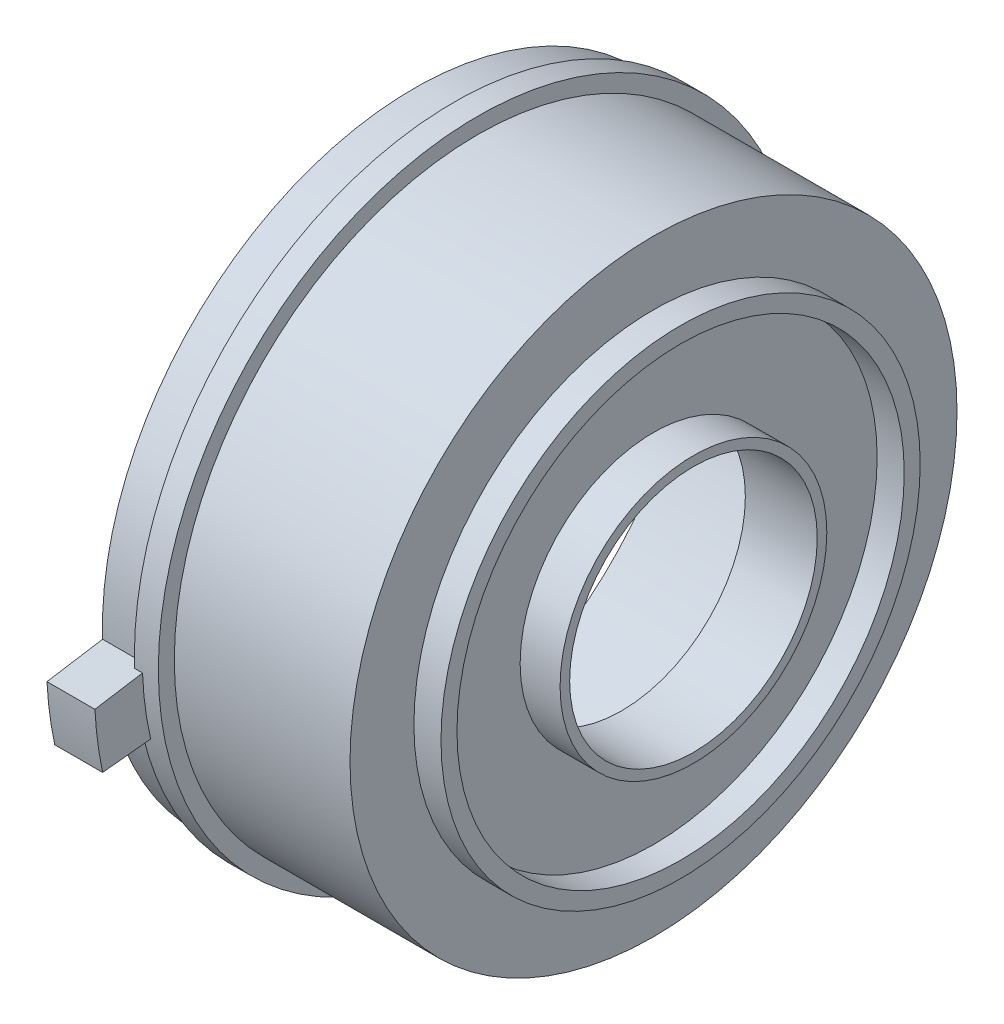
ISO-10303-21;
HEADER;
FILE_DESCRIPTION(('STEP AP214'),'2;1');
FILE_NAME('part.step','',(''),(''),'','','');
FILE_SCHEMA(('AUTOMOTIVE_DESIGN { 1 0 10303 214 1 1 1 1 }'));
ENDSEC;
DATA;
#1=APPLICATION_CONTEXT('core data for automotive mechanical design processes');
#2=APPLICATION_PROTOCOL_DEFINITION('international standard','automotive_design',2000,#1);
#3=PRODUCT_CONTEXT('',#1,'mechanical');
#4=PRODUCT('Part','Part','',(#3));
#5=PRODUCT_RELATED_PRODUCT_CATEGORY('part','',(#4));
#6=PRODUCT_DEFINITION_FORMATION('','',#4);
#7=PRODUCT_DEFINITION_CONTEXT('part definition',#1,'design');
#8=PRODUCT_DEFINITION('design','',#6,#7);
#9=PRODUCT_DEFINITION_SHAPE('','',#8);
#10=(LENGTH_UNIT() NAMED_UNIT(*) SI_UNIT(.MILLI.,.METRE.));
#11=(NAMED_UNIT(*) PLANE_ANGLE_UNIT() SI_UNIT($,.RADIAN.));
#12=(NAMED_UNIT(*) SI_UNIT($,.STERADIAN.) SOLID_ANGLE_UNIT());
#13=UNCERTAINTY_MEASURE_WITH_UNIT(LENGTH_MEASURE(1.E-05),#10,'distance_accuracy_value','');
#14=(GEOMETRIC_REPRESENTATION_CONTEXT(3) GLOBAL_UNCERTAINTY_ASSIGNED_CONTEXT((#13)) GLOBAL_UNIT_ASSIGNED_CONTEXT((#10,
#11,#12)) REPRESENTATION_CONTEXT('',''));
#15=CARTESIAN_POINT('',(0.,0.,0.));
#16=DIRECTION('',(0.,0.,1.));
#17=DIRECTION('',(1.,0.,0.));
#18=AXIS2_PLACEMENT_3D('',#15,#16,#17);
#19=CARTESIAN_POINT('',(0.,0.,0.));
#20=DIRECTION('',(-1.,0.,0.));
#21=DIRECTION('',(0.,0.,1.));
#22=AXIS2_PLACEMENT_3D('',#19,#20,#21);
#23=CYLINDRICAL_SURFACE('',#22,19.);
#24=CARTESIAN_POINT('',(101.,0.,0.));
#25=DIRECTION('',(-1.,0.,0.));
#26=DIRECTION('',(0.,0.,1.));
#27=AXIS2_PLACEMENT_3D('',#24,#25,#26);
#28=CIRCLE('',#27,19.);
#29=CARTESIAN_POINT('',(101.,0.,19.));
#30=VERTEX_POINT('',#29);
#31=EDGE_CURVE('E38',#30,#30,#28,.T.);
#32=ORIENTED_EDGE('',*,*,#31,.F.);
#33=EDGE_LOOP('',(#32));
#34=FACE_BOUND('',#33,.T.);
#35=CARTESIAN_POINT('',(112.,0.,0.));
#36=DIRECTION('',(-1.,0.,0.));
#37=DIRECTION('',(0.,0.,1.));
#38=AXIS2_PLACEMENT_3D('',#35,#36,#37);
#39=CIRCLE('',#38,19.);
#40=CARTESIAN_POINT('',(112.,0.,19.));
#41=VERTEX_POINT('',#40);
#42=EDGE_CURVE('E127',#41,#41,#39,.T.);
#43=ORIENTED_EDGE('',*,*,#42,.T.);
#44=EDGE_LOOP('',(#43));
#45=FACE_BOUND('',#44,.T.);
#46=ADVANCED_FACE('F31',(#34,#45),#23,.T.);
#47=CARTESIAN_POINT('',(101.,19.9999999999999,0.));
#48=DIRECTION('',(-1.,0.,0.));
#49=DIRECTION('',(0.,0.,1.));
#50=AXIS2_PLACEMENT_3D('',#47,#48,#49);
#51=PLANE('',#50);
#52=CARTESIAN_POINT('',(101.,0.,0.));
#53=DIRECTION('',(-1.,0.,0.));
#54=DIRECTION('',(0.,0.,1.));
#55=AXIS2_PLACEMENT_3D('',#52,#53,#54);
#56=CIRCLE('',#55,19.9999999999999);
#57=CARTESIAN_POINT('',(101.,0.,19.9999999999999));
#58=VERTEX_POINT('',#57);
#59=EDGE_CURVE('E168',#58,#58,#56,.T.);
#60=ORIENTED_EDGE('',*,*,#59,.F.);
#61=EDGE_LOOP('',(#60));
#62=FACE_BOUND('',#61,.T.);
#63=ORIENTED_EDGE('',*,*,#31,.T.);
#64=EDGE_LOOP('',(#63));
#65=FACE_BOUND('',#64,.T.);
#66=ADVANCED_FACE('F173',(#62,#65),#51,.F.);
#67=CARTESIAN_POINT('',(0.,0.,0.));
#68=DIRECTION('',(-1.,0.,0.));
#69=DIRECTION('',(0.,0.,1.));
#70=AXIS2_PLACEMENT_3D('',#67,#68,#69);
#71=CYLINDRICAL_SURFACE('',#70,19.9999999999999);
#72=CARTESIAN_POINT('',(99.9999999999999,0.,0.));
#73=DIRECTION('',(-1.,0.,0.));
#74=DIRECTION('',(0.,0.,1.));
#75=AXIS2_PLACEMENT_3D('',#72,#73,#74);
#76=CIRCLE('',#75,19.9999999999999);
#77=CARTESIAN_POINT('',(99.9999999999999,-4.53165061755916,19.4798393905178));
#78=VERTEX_POINT('',#77);
#79=CARTESIAN_POINT('',(99.9999999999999,-0.697530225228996,19.9878325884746));
#80=VERTEX_POINT('',#79);
#81=EDGE_CURVE('E11',#78,#80,#76,.T.);
#82=ORIENTED_EDGE('',*,*,#81,.F.);
#83=DIRECTION('',(-1.,0.,0.));
#84=VECTOR('',#83,1.);
#85=CARTESIAN_POINT('',(0.,-4.53165061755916,19.4798393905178));
#86=LINE('',#85,#84);
#87=CARTESIAN_POINT('',(99.4999999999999,-4.53165061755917,19.4798393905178));
#88=VERTEX_POINT('',#87);
#89=EDGE_CURVE('E125',#78,#88,#86,.T.);
#90=ORIENTED_EDGE('',*,*,#89,.T.);
#91=CARTESIAN_POINT('',(99.4999999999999,0.,0.));
#92=DIRECTION('',(-1.,0.,0.));
#93=DIRECTION('',(0.,0.,1.));
#94=AXIS2_PLACEMENT_3D('',#91,#92,#93);
#95=CIRCLE('',#94,19.9999999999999);
#96=CARTESIAN_POINT('',(99.4999999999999,-0.697530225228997,19.9878325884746));
#97=VERTEX_POINT('',#96);
#98=EDGE_CURVE('E165',#97,#88,#95,.T.);
#99=ORIENTED_EDGE('',*,*,#98,.F.);
#100=DIRECTION('',(-1.,0.,0.));
#101=VECTOR('',#100,1.);
#102=CARTESIAN_POINT('',(0.,-0.697530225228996,19.9878325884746));
#103=LINE('',#102,#101);
#104=EDGE_CURVE('E119',#97,#80,#103,.F.);
#105=ORIENTED_EDGE('',*,*,#104,.T.);
#106=EDGE_LOOP('',(#82,#90,#99,#105));
#107=FACE_BOUND('',#106,.T.);
#108=ORIENTED_EDGE('',*,*,#59,.T.);
#109=EDGE_LOOP('',(#108));
#110=FACE_BOUND('',#109,.T.);
#111=ADVANCED_FACE('F251',(#107,#110),#71,.T.);
#112=CARTESIAN_POINT('',(99.4999999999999,19.5,0.));
#113=DIRECTION('',(1.,0.,0.));
#114=DIRECTION('',(0.,0.,-1.));
#115=AXIS2_PLACEMENT_3D('',#112,#113,#114);
#116=PLANE('',#115);
#117=ORIENTED_EDGE('',*,*,#98,.T.);
#118=DIRECTION('',(0.,0.103785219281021,-0.994599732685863));
#119=VECTOR('',#118,1.);
#120=CARTESIAN_POINT('',(99.4999999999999,-2.26199519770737,-2.27083656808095));
#121=LINE('',#120,#119);
#122=CARTESIAN_POINT('',(99.4999999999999,-4.47934207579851,18.9785535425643));
#123=VERTEX_POINT('',#122);
#124=EDGE_CURVE('E53',#88,#123,#121,.T.);
#125=ORIENTED_EDGE('',*,*,#124,.T.);
#126=CARTESIAN_POINT('',(99.4999999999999,0.,0.));
#127=DIRECTION('',(-1.,0.,0.));
#128=DIRECTION('',(0.,0.,1.));
#129=AXIS2_PLACEMENT_3D('',#126,#127,#128);
#130=CIRCLE('',#129,19.5);
#131=CARTESIAN_POINT('',(99.4999999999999,-0.617492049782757,19.4902207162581));
#132=VERTEX_POINT('',#131);
#133=EDGE_CURVE('E162',#132,#123,#130,.T.);
#134=ORIENTED_EDGE('',*,*,#133,.F.);
#135=DIRECTION('',(0.,-0.158803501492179,0.987310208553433));
#136=VECTOR('',#135,1.);
#137=CARTESIAN_POINT('',(99.4999999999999,2.94568089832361,-2.66267259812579));
#138=LINE('',#137,#136);
#139=EDGE_CURVE('E116',#132,#97,#138,.T.);
#140=ORIENTED_EDGE('',*,*,#139,.T.);
#141=EDGE_LOOP('',(#117,#125,#134,#140));
#142=FACE_BOUND('',#141,.T.);
#143=ADVANCED_FACE('F248',(#142),#116,.F.);
#144=CARTESIAN_POINT('',(0.,0.,0.));
#145=DIRECTION('',(-1.,0.,0.));
#146=DIRECTION('',(0.,0.,1.));
#147=AXIS2_PLACEMENT_3D('',#144,#145,#146);
#148=CYLINDRICAL_SURFACE('',#147,19.5);
#149=ORIENTED_EDGE('',*,*,#133,.T.);
#150=DIRECTION('',(-1.,0.,0.));
#151=VECTOR('',#150,1.);
#152=CARTESIAN_POINT('',(0.,-4.47934207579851,18.9785535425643));
#153=LINE('',#152,#151);
#154=CARTESIAN_POINT('',(96.9999999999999,-4.47934207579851,18.9785535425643));
#155=VERTEX_POINT('',#154);
#156=EDGE_CURVE('E121',#123,#155,#153,.T.);
#157=ORIENTED_EDGE('',*,*,#156,.T.);
#158=CARTESIAN_POINT('',(96.9999999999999,0.,0.));
#159=DIRECTION('',(-1.,0.,0.));
#160=DIRECTION('',(0.,0.,1.));
#161=AXIS2_PLACEMENT_3D('',#158,#159,#160);
#162=CIRCLE('',#161,19.5);
#163=CARTESIAN_POINT('',(96.9999999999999,-0.617492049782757,19.4902207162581));
#164=VERTEX_POINT('',#163);
#165=EDGE_CURVE('E160',#164,#155,#162,.T.);
#166=ORIENTED_EDGE('',*,*,#165,.F.);
#167=DIRECTION('',(-1.,0.,0.));
#168=VECTOR('',#167,1.);
#169=CARTESIAN_POINT('',(0.,-0.617492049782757,19.4902207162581));
#170=LINE('',#169,#168);
#171=EDGE_CURVE('E112',#164,#132,#170,.F.);
#172=ORIENTED_EDGE('',*,*,#171,.T.);
#173=EDGE_LOOP('',(#149,#157,#166,#172));
#174=FACE_BOUND('',#173,.T.);
#175=ADVANCED_FACE('F241',(#174),#148,.T.);
#176=CARTESIAN_POINT('',(96.9999999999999,19.5,0.));
#177=DIRECTION('',(1.,0.,0.));
#178=DIRECTION('',(0.,0.,-1.));
#179=AXIS2_PLACEMENT_3D('',#176,#177,#178);
#180=PLANE('',#179);
#181=CARTESIAN_POINT('',(96.9999999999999,0.,0.));
#182=DIRECTION('',(-1.,0.,0.));
#183=DIRECTION('',(0.,0.,1.));
#184=AXIS2_PLACEMENT_3D('',#181,#182,#183);
#185=CIRCLE('',#184,17.5);
#186=CARTESIAN_POINT('',(96.9999999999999,0.,17.5));
#187=VERTEX_POINT('',#186);
#188=EDGE_CURVE('E157',#187,#187,#185,.T.);
#189=ORIENTED_EDGE('',*,*,#188,.F.);
#190=EDGE_LOOP('',(#189));
#191=FACE_BOUND('',#190,.T.);
#192=ORIENTED_EDGE('',*,*,#165,.T.);
#193=DIRECTION('',(0.,-0.103785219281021,0.994599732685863));
#194=VECTOR('',#193,1.);
#195=CARTESIAN_POINT('',(96.9999999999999,-4.42701136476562,18.4770552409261));
#196=LINE('',#195,#194);
#197=CARTESIAN_POINT('',(96.9999999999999,-4.84511836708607,22.4838792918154));
#198=VERTEX_POINT('',#197);
#199=EDGE_CURVE('E104',#155,#198,#196,.T.);
#200=ORIENTED_EDGE('',*,*,#199,.T.);
#201=CARTESIAN_POINT('',(96.9999999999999,0.,0.));
#202=DIRECTION('',(-1.,0.,0.));
#203=DIRECTION('',(0.,0.,1.));
#204=AXIS2_PLACEMENT_3D('',#201,#202,#203);
#205=CIRCLE('',#204,23.);
#206=CARTESIAN_POINT('',(96.9999999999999,-1.17717247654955,22.969855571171));
#207=VERTEX_POINT('',#206);
#208=EDGE_CURVE('E109',#198,#207,#205,.T.);
#209=ORIENTED_EDGE('',*,*,#208,.T.);
#210=DIRECTION('',(0.,0.158803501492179,-0.987310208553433));
#211=VECTOR('',#210,1.);
#212=CARTESIAN_POINT('',(96.9999999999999,-1.17717247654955,22.969855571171));
#213=LINE('',#212,#211);
#214=EDGE_CURVE('E45',#207,#164,#213,.T.);
#215=ORIENTED_EDGE('',*,*,#214,.T.);
#216=EDGE_LOOP('',(#192,#200,#209,#215));
#217=FACE_BOUND('',#216,.T.);
#218=ADVANCED_FACE('F236',(#191,#217),#180,.F.);
#219=CARTESIAN_POINT('',(0.,0.,0.));
#220=DIRECTION('',(-1.,0.,0.));
#221=DIRECTION('',(0.,0.,1.));
#222=AXIS2_PLACEMENT_3D('',#219,#220,#221);
#223=CYLINDRICAL_SURFACE('',#222,17.5);
#224=CARTESIAN_POINT('',(110.,0.,0.));
#225=DIRECTION('',(-1.,0.,0.));
#226=DIRECTION('',(0.,0.,1.));
#227=AXIS2_PLACEMENT_3D('',#224,#225,#226);
#228=CIRCLE('',#227,17.5);
#229=CARTESIAN_POINT('',(110.,0.,17.5));
#230=VERTEX_POINT('',#229);
#231=EDGE_CURVE('E154',#230,#230,#228,.T.);
#232=ORIENTED_EDGE('',*,*,#231,.F.);
#233=EDGE_LOOP('',(#232));
#234=FACE_BOUND('',#233,.T.);
#235=ORIENTED_EDGE('',*,*,#188,.T.);
#236=EDGE_LOOP('',(#235));
#237=FACE_BOUND('',#236,.T.);
#238=ADVANCED_FACE('F230',(#234,#237),#223,.F.);
#239=CARTESIAN_POINT('',(110.,17.5,0.));
#240=DIRECTION('',(1.,0.,0.));
#241=DIRECTION('',(0.,0.,-1.));
#242=AXIS2_PLACEMENT_3D('',#239,#240,#241);
#243=PLANE('',#242);
#244=CARTESIAN_POINT('',(110.,0.,0.));
#245=DIRECTION('',(-1.,0.,0.));
#246=DIRECTION('',(0.,0.,1.));
#247=AXIS2_PLACEMENT_3D('',#244,#245,#246);
#248=CIRCLE('',#247,7.75);
#249=CARTESIAN_POINT('',(110.,0.,7.75));
#250=VERTEX_POINT('',#249);
#251=EDGE_CURVE('E151',#250,#250,#248,.T.);
#252=ORIENTED_EDGE('',*,*,#251,.F.);
#253=EDGE_LOOP('',(#252));
#254=FACE_BOUND('',#253,.T.);
#255=ORIENTED_EDGE('',*,*,#231,.T.);
#256=EDGE_LOOP('',(#255));
#257=FACE_BOUND('',#256,.T.);
#258=ADVANCED_FACE('F224',(#254,#257),#243,.F.);
#259=CARTESIAN_POINT('',(0.,0.,0.));
#260=DIRECTION('',(-1.,0.,0.));
#261=DIRECTION('',(0.,0.,1.));
#262=AXIS2_PLACEMENT_3D('',#259,#260,#261);
#263=CYLINDRICAL_SURFACE('',#262,7.75);
#264=CARTESIAN_POINT('',(114.5,0.,0.));
#265=DIRECTION('',(-1.,0.,0.));
#266=DIRECTION('',(0.,0.,1.));
#267=AXIS2_PLACEMENT_3D('',#264,#265,#266);
#268=CIRCLE('',#267,7.75);
#269=CARTESIAN_POINT('',(114.5,0.,7.75));
#270=VERTEX_POINT('',#269);
#271=EDGE_CURVE('E148',#270,#270,#268,.T.);
#272=ORIENTED_EDGE('',*,*,#271,.F.);
#273=EDGE_LOOP('',(#272));
#274=FACE_BOUND('',#273,.T.);
#275=ORIENTED_EDGE('',*,*,#251,.T.);
#276=EDGE_LOOP('',(#275));
#277=FACE_BOUND('',#276,.T.);
#278=ADVANCED_FACE('F218',(#274,#277),#263,.F.);
#279=CARTESIAN_POINT('',(114.5,8.35,0.));
#280=DIRECTION('',(-1.,0.,0.));
#281=DIRECTION('',(0.,0.,1.));
#282=AXIS2_PLACEMENT_3D('',#279,#280,#281);
#283=PLANE('',#282);
#284=CARTESIAN_POINT('',(114.5,0.,0.));
#285=DIRECTION('',(-1.,0.,0.));
#286=DIRECTION('',(0.,0.,1.));
#287=AXIS2_PLACEMENT_3D('',#284,#285,#286);
#288=CIRCLE('',#287,8.35);
#289=CARTESIAN_POINT('',(114.5,0.,8.35));
#290=VERTEX_POINT('',#289);
#291=EDGE_CURVE('E145',#290,#290,#288,.T.);
#292=ORIENTED_EDGE('',*,*,#291,.F.);
#293=EDGE_LOOP('',(#292));
#294=FACE_BOUND('',#293,.T.);
#295=ORIENTED_EDGE('',*,*,#271,.T.);
#296=EDGE_LOOP('',(#295));
#297=FACE_BOUND('',#296,.T.);
#298=ADVANCED_FACE('F212',(#294,#297),#283,.F.);
#299=CARTESIAN_POINT('',(0.,0.,0.));
#300=DIRECTION('',(-1.,0.,0.));
#301=DIRECTION('',(0.,0.,1.));
#302=AXIS2_PLACEMENT_3D('',#299,#300,#301);
#303=CYLINDRICAL_SURFACE('',#302,8.35);
#304=CARTESIAN_POINT('',(112.,0.,0.));
#305=DIRECTION('',(-1.,0.,0.));
#306=DIRECTION('',(0.,0.,1.));
#307=AXIS2_PLACEMENT_3D('',#304,#305,#306);
#308=CIRCLE('',#307,8.35);
#309=CARTESIAN_POINT('',(112.,0.,8.35));
#310=VERTEX_POINT('',#309);
#311=EDGE_CURVE('E142',#310,#310,#308,.T.);
#312=ORIENTED_EDGE('',*,*,#311,.F.);
#313=EDGE_LOOP('',(#312));
#314=FACE_BOUND('',#313,.T.);
#315=ORIENTED_EDGE('',*,*,#291,.T.);
#316=EDGE_LOOP('',(#315));
#317=FACE_BOUND('',#316,.T.);
#318=ADVANCED_FACE('F206',(#314,#317),#303,.T.);
#319=CARTESIAN_POINT('',(112.,8.35,0.));
#320=DIRECTION('',(-1.,0.,0.));
#321=DIRECTION('',(0.,0.,1.));
#322=AXIS2_PLACEMENT_3D('',#319,#320,#321);
#323=PLANE('',#322);
#324=CARTESIAN_POINT('',(112.,0.,0.));
#325=DIRECTION('',(-1.,0.,0.));
#326=DIRECTION('',(0.,0.,1.));
#327=AXIS2_PLACEMENT_3D('',#324,#325,#326);
#328=CIRCLE('',#327,14.);
#329=CARTESIAN_POINT('',(112.,0.,14.));
#330=VERTEX_POINT('',#329);
#331=EDGE_CURVE('E139',#330,#330,#328,.T.);
#332=ORIENTED_EDGE('',*,*,#331,.F.);
#333=EDGE_LOOP('',(#332));
#334=FACE_BOUND('',#333,.T.);
#335=ORIENTED_EDGE('',*,*,#311,.T.);
#336=EDGE_LOOP('',(#335));
#337=FACE_BOUND('',#336,.T.);
#338=ADVANCED_FACE('F200',(#334,#337),#323,.F.);
#339=CARTESIAN_POINT('',(0.,0.,0.));
#340=DIRECTION('',(-1.,0.,0.));
#341=DIRECTION('',(0.,0.,1.));
#342=AXIS2_PLACEMENT_3D('',#339,#340,#341);
#343=CYLINDRICAL_SURFACE('',#342,14.);
#344=CARTESIAN_POINT('',(113.695178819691,0.,0.));
#345=DIRECTION('',(-1.,0.,0.));
#346=DIRECTION('',(0.,0.,1.));
#347=AXIS2_PLACEMENT_3D('',#344,#345,#346);
#348=CIRCLE('',#347,14.);
#349=CARTESIAN_POINT('',(113.695178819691,0.,14.));
#350=VERTEX_POINT('',#349);
#351=EDGE_CURVE('E136',#350,#350,#348,.T.);
#352=ORIENTED_EDGE('',*,*,#351,.F.);
#353=EDGE_LOOP('',(#352));
#354=FACE_BOUND('',#353,.T.);
#355=ORIENTED_EDGE('',*,*,#331,.T.);
#356=EDGE_LOOP('',(#355));
#357=FACE_BOUND('',#356,.T.);
#358=ADVANCED_FACE('F194',(#354,#357),#343,.F.);
#359=CARTESIAN_POINT('',(113.695178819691,15.,0.));
#360=DIRECTION('',(-1.,0.,0.));
#361=DIRECTION('',(0.,0.,1.));
#362=AXIS2_PLACEMENT_3D('',#359,#360,#361);
#363=PLANE('',#362);
#364=CARTESIAN_POINT('',(113.695178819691,0.,0.));
#365=DIRECTION('',(-1.,0.,0.));
#366=DIRECTION('',(0.,0.,1.));
#367=AXIS2_PLACEMENT_3D('',#364,#365,#366);
#368=CIRCLE('',#367,15.);
#369=CARTESIAN_POINT('',(113.695178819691,0.,15.));
#370=VERTEX_POINT('',#369);
#371=EDGE_CURVE('E133',#370,#370,#368,.T.);
#372=ORIENTED_EDGE('',*,*,#371,.F.);
#373=EDGE_LOOP('',(#372));
#374=FACE_BOUND('',#373,.T.);
#375=ORIENTED_EDGE('',*,*,#351,.T.);
#376=EDGE_LOOP('',(#375));
#377=FACE_BOUND('',#376,.T.);
#378=ADVANCED_FACE('F188',(#374,#377),#363,.F.);
#379=CARTESIAN_POINT('',(0.,0.,0.));
#380=DIRECTION('',(-1.,0.,0.));
#381=DIRECTION('',(0.,0.,1.));
#382=AXIS2_PLACEMENT_3D('',#379,#380,#381);
#383=CYLINDRICAL_SURFACE('',#382,15.);
#384=CARTESIAN_POINT('',(112.,0.,0.));
#385=DIRECTION('',(-1.,0.,0.));
#386=DIRECTION('',(0.,0.,1.));
#387=AXIS2_PLACEMENT_3D('',#384,#385,#386);
#388=CIRCLE('',#387,15.);
#389=CARTESIAN_POINT('',(112.,0.,15.));
#390=VERTEX_POINT('',#389);
#391=EDGE_CURVE('E130',#390,#390,#388,.T.);
#392=ORIENTED_EDGE('',*,*,#391,.F.);
#393=EDGE_LOOP('',(#392));
#394=FACE_BOUND('',#393,.T.);
#395=ORIENTED_EDGE('',*,*,#371,.T.);
#396=EDGE_LOOP('',(#395));
#397=FACE_BOUND('',#396,.T.);
#398=ADVANCED_FACE('F182',(#394,#397),#383,.T.);
#399=CARTESIAN_POINT('',(112.,15.,0.));
#400=DIRECTION('',(-1.,0.,0.));
#401=DIRECTION('',(0.,0.,1.));
#402=AXIS2_PLACEMENT_3D('',#399,#400,#401);
#403=PLANE('',#402);
#404=ORIENTED_EDGE('',*,*,#42,.F.);
#405=EDGE_LOOP('',(#404));
#406=FACE_BOUND('',#405,.T.);
#407=ORIENTED_EDGE('',*,*,#391,.T.);
#408=EDGE_LOOP('',(#407));
#409=FACE_BOUND('',#408,.T.);
#410=ADVANCED_FACE('F179',(#406,#409),#403,.F.);
#411=CARTESIAN_POINT('',(99.9999999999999,0.,0.));
#412=DIRECTION('',(-1.,0.,0.));
#413=DIRECTION('',(0.,0.,1.));
#414=AXIS2_PLACEMENT_3D('',#411,#412,#413);
#415=PLANE('',#414);
#416=DIRECTION('',(0.,-0.103785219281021,0.994599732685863));
#417=VECTOR('',#416,1.);
#418=CARTESIAN_POINT('',(99.9999999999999,-4.42701136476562,18.4770552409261));
#419=LINE('',#418,#417);
#420=CARTESIAN_POINT('',(99.9999999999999,-4.84511836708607,22.4838792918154));
#421=VERTEX_POINT('',#420);
#422=EDGE_CURVE('E92',#78,#421,#419,.T.);
#423=ORIENTED_EDGE('',*,*,#422,.F.);
#424=ORIENTED_EDGE('',*,*,#81,.T.);
#425=DIRECTION('',(0.,0.158803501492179,-0.987310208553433));
#426=VECTOR('',#425,1.);
#427=CARTESIAN_POINT('',(99.9999999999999,-1.17717247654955,22.969855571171));
#428=LINE('',#427,#426);
#429=CARTESIAN_POINT('',(99.9999999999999,-1.17717247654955,22.969855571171));
#430=VERTEX_POINT('',#429);
#431=EDGE_CURVE('E86',#430,#80,#428,.T.);
#432=ORIENTED_EDGE('',*,*,#431,.F.);
#433=CARTESIAN_POINT('',(99.9999999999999,0.,0.));
#434=DIRECTION('',(-1.,0.,0.));
#435=DIRECTION('',(0.,0.,1.));
#436=AXIS2_PLACEMENT_3D('',#433,#434,#435);
#437=CIRCLE('',#436,23.);
#438=EDGE_CURVE('E98',#421,#430,#437,.T.);
#439=ORIENTED_EDGE('',*,*,#438,.F.);
#440=EDGE_LOOP('',(#423,#424,#432,#439));
#441=FACE_BOUND('',#440,.T.);
#442=ADVANCED_FACE('F97',(#441),#415,.F.);
#443=CARTESIAN_POINT('',(99.9999999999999,-4.42701136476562,18.4770552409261));
#444=DIRECTION('',(0.,-0.994599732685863,-0.103785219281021));
#445=DIRECTION('',(0.,0.103785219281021,-0.994599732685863));
#446=AXIS2_PLACEMENT_3D('',#443,#444,#445);
#447=PLANE('',#446);
#448=ORIENTED_EDGE('',*,*,#89,.F.);
#449=ORIENTED_EDGE('',*,*,#422,.T.);
#450=DIRECTION('',(-1.,0.,0.));
#451=VECTOR('',#450,1.);
#452=CARTESIAN_POINT('',(99.9999999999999,-4.84511836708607,22.4838792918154));
#453=LINE('',#452,#451);
#454=EDGE_CURVE('E91',#421,#198,#453,.T.);
#455=ORIENTED_EDGE('',*,*,#454,.T.);
#456=ORIENTED_EDGE('',*,*,#199,.F.);
#457=ORIENTED_EDGE('',*,*,#156,.F.);
#458=ORIENTED_EDGE('',*,*,#124,.F.);
#459=EDGE_LOOP('',(#448,#449,#455,#456,#457,#458));
#460=FACE_BOUND('',#459,.T.);
#461=ADVANCED_FACE('F246',(#460),#447,.T.);
#462=CARTESIAN_POINT('',(99.9999999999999,-1.17717247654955,22.969855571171));
#463=DIRECTION('',(0.,0.987310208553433,0.158803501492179));
#464=DIRECTION('',(0.,-0.158803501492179,0.987310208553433));
#465=AXIS2_PLACEMENT_3D('',#462,#463,#464);
#466=PLANE('',#465);
#467=ORIENTED_EDGE('',*,*,#104,.F.);
#468=ORIENTED_EDGE('',*,*,#139,.F.);
#469=ORIENTED_EDGE('',*,*,#171,.F.);
#470=ORIENTED_EDGE('',*,*,#214,.F.);
#471=DIRECTION('',(-1.,0.,0.));
#472=VECTOR('',#471,1.);
#473=CARTESIAN_POINT('',(99.9999999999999,-1.17717247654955,22.969855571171));
#474=LINE('',#473,#472);
#475=EDGE_CURVE('E83',#430,#207,#474,.T.);
#476=ORIENTED_EDGE('',*,*,#475,.F.);
#477=ORIENTED_EDGE('',*,*,#431,.T.);
#478=EDGE_LOOP('',(#467,#468,#469,#470,#476,#477));
#479=FACE_BOUND('',#478,.T.);
#480=ADVANCED_FACE('F85',(#479),#466,.T.);
#481=CARTESIAN_POINT('',(99.9999999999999,0.,0.));
#482=DIRECTION('',(-1.,0.,0.));
#483=DIRECTION('',(0.,0.,1.));
#484=AXIS2_PLACEMENT_3D('',#481,#482,#483);
#485=CYLINDRICAL_SURFACE('',#484,23.);
#486=ORIENTED_EDGE('',*,*,#208,.F.);
#487=ORIENTED_EDGE('',*,*,#454,.F.);
#488=ORIENTED_EDGE('',*,*,#438,.T.);
#489=ORIENTED_EDGE('',*,*,#475,.T.);
#490=EDGE_LOOP('',(#486,#487,#488,#489));
#491=FACE_BOUND('',#490,.T.);
#492=ADVANCED_FACE('F102',(#491),#485,.T.);
#493=CLOSED_SHELL('',(#46,#66,#111,#143,#175,#218,#238,#258,#278,#298,#318,#338,#358,#378,#398,
#410,#442,#461,#480,#492));
#494=MANIFOLD_SOLID_BREP('B2',#493);
#495=ADVANCED_BREP_SHAPE_REPRESENTATION('',(#18,#494),#14);
#496=SHAPE_DEFINITION_REPRESENTATION(#9,#495);
ENDSEC;
END-ISO-10303-21;
